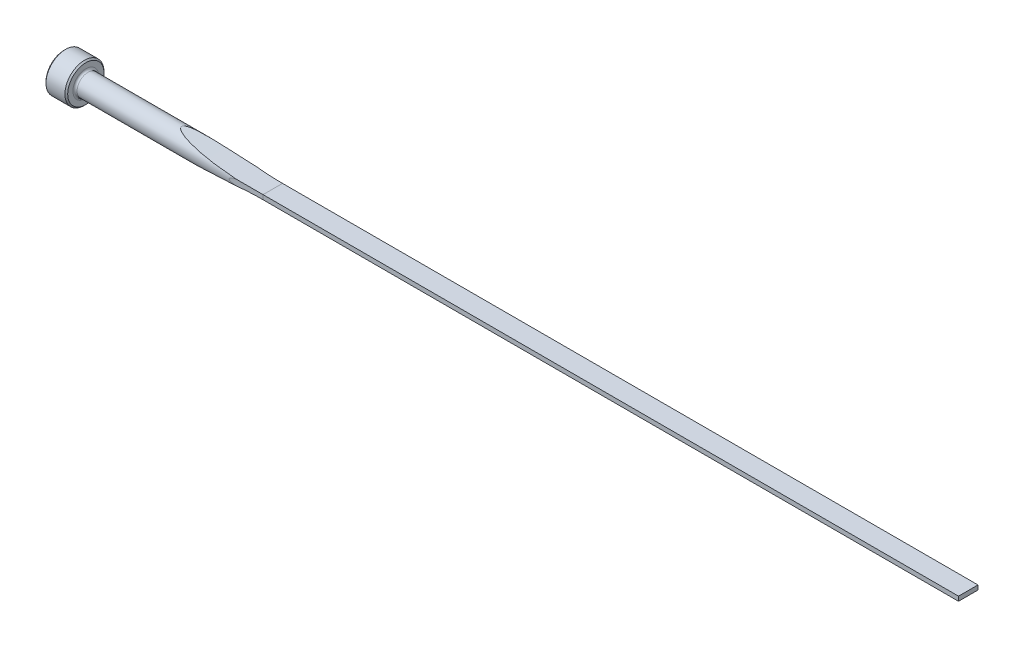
from build123d import *

# Parameters (mm, degrees)
CUT_EXTRUDE1_DEPTH = 166.177120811
CUT_EXTRUDE2_DEPTH = 166.177120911
FILLET1_R          = 0.381
CHAMFER1_SIZE      = 0.254


with BuildPart() as part:
    # Sketch1 → Revolve1 (revolve)
    with BuildSketch(Plane.XY, mode=Mode.PRIVATE) as revolve1_sk:
        Polygon((0, 0), (0, 3.5687), (3.9624, 3.5687), (3.9624, 1.9812), (165.1, 1.9812), (165.1, 0), align=None)
    revolve(revolve1_sk.sketch.rotate(Axis((0, 0, 0), (1, 0, 0)), 90), axis=Axis((0, 0, 0), (1, 0, 0)))

    # Sketch2 → Cut-Extrude1 (cut, symmetric)
    with BuildSketch(Plane.XY):
        with BuildLine():
            Line((165.1, 1.9812), (165.1, 0.4064))
            Line((165.1, 0.4064), (38.1, 0.4064))
            ThreePointArc((38.1, 0.4064), (29.733408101, 0.800975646), (21.441085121, 1.9812))
            Line((21.441085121, 1.9812), (165.1, 1.9812))
        make_face()
    cut_extrude1 = extrude(amount=CUT_EXTRUDE1_DEPTH, both=True, mode=Mode.SUBTRACT)

    # Mirror1: Cut-Extrude1 across plane
    add(cut_extrude1.mirror(Plane.ZX), mode=Mode.SUBTRACT)

    # Sketch3 → Cut-Extrude2 (cut, symmetric)
    with BuildSketch(Plane(origin=(0, 0, 0), x_dir=(1, 0, 0), z_dir=(0, 1, 0))):
        with BuildLine():
            Line((165.1, 1.9812), (165.1, 1.778))
            Line((165.1, 1.778), (38.1, 1.778))
            ThreePointArc((38.1, 1.778), (35.09463147, 1.828814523), (32.092698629, 1.9812))
            Line((32.092698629, 1.9812), (165.1, 1.9812))
        make_face()
    cut_extrude2 = extrude(amount=CUT_EXTRUDE2_DEPTH, both=True, mode=Mode.SUBTRACT)

    # Mirror2: Cut-Extrude2 across plane
    add(cut_extrude2.mirror(Plane.XY), mode=Mode.SUBTRACT)

    # Fillet1
    fillet1_edges = [part.edges().sort_by_distance(p)[0] for p in [
        (3.9624, 0, -1.9812),
    ]]
    fillet(fillet1_edges, radius=FILLET1_R)

    # Chamfer1
    chamfer1_edges = [part.edges().sort_by_distance(p)[0] for p in [
        (3.9624, 0, -3.5687),
        (0, 0, -3.5687),
    ]]
    chamfer(chamfer1_edges, length=CHAMFER1_SIZE)


solid = part.part
